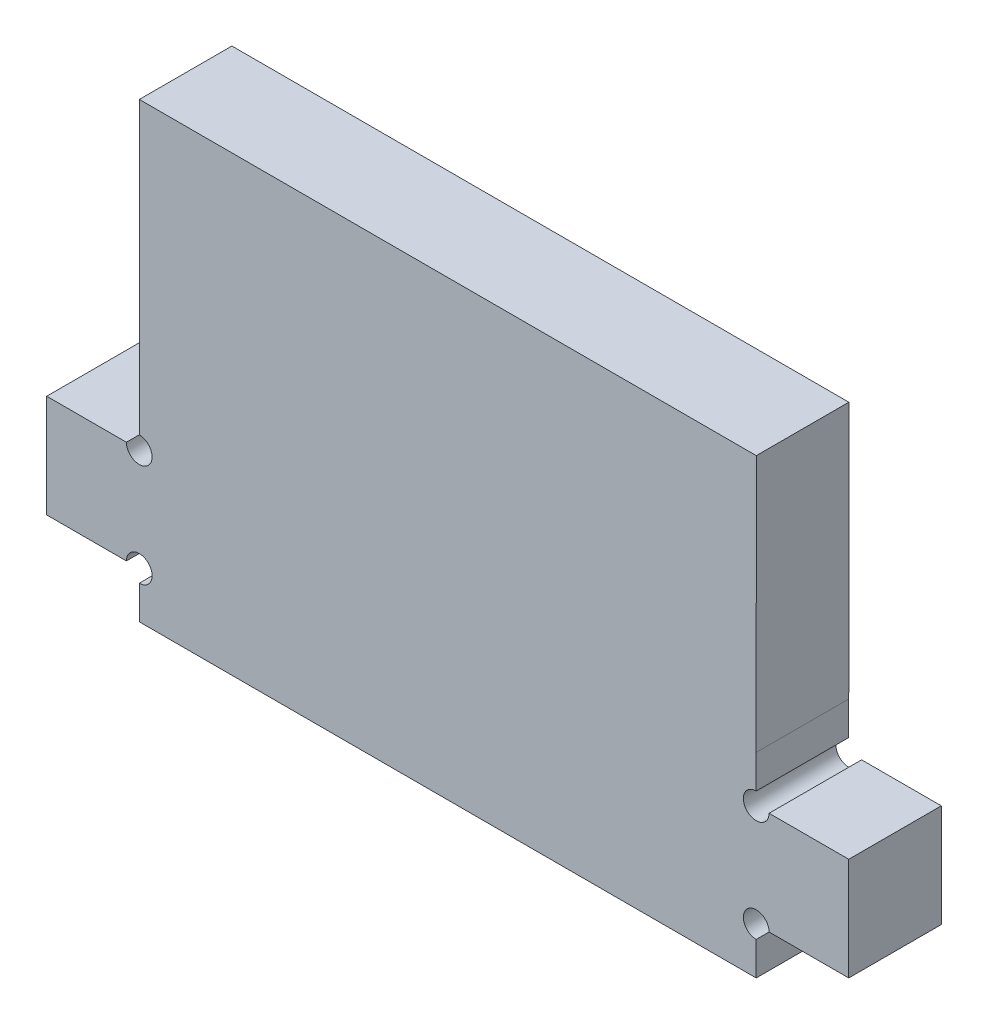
ISO-10303-21;
HEADER;
FILE_DESCRIPTION(('STEP AP214'),'2;1');
FILE_NAME('part.step','',(''),(''),'','','');
FILE_SCHEMA(('AUTOMOTIVE_DESIGN { 1 0 10303 214 1 1 1 1 }'));
ENDSEC;
DATA;
#1=APPLICATION_CONTEXT('core data for automotive mechanical design processes');
#2=APPLICATION_PROTOCOL_DEFINITION('international standard','automotive_design',2000,#1);
#3=PRODUCT_CONTEXT('',#1,'mechanical');
#4=PRODUCT('Part','Part','',(#3));
#5=PRODUCT_RELATED_PRODUCT_CATEGORY('part','',(#4));
#6=PRODUCT_DEFINITION_FORMATION('','',#4);
#7=PRODUCT_DEFINITION_CONTEXT('part definition',#1,'design');
#8=PRODUCT_DEFINITION('design','',#6,#7);
#9=PRODUCT_DEFINITION_SHAPE('','',#8);
#10=(LENGTH_UNIT() NAMED_UNIT(*) SI_UNIT(.MILLI.,.METRE.));
#11=(NAMED_UNIT(*) PLANE_ANGLE_UNIT() SI_UNIT($,.RADIAN.));
#12=(NAMED_UNIT(*) SI_UNIT($,.STERADIAN.) SOLID_ANGLE_UNIT());
#13=UNCERTAINTY_MEASURE_WITH_UNIT(LENGTH_MEASURE(1.E-05),#10,'distance_accuracy_value','');
#14=(GEOMETRIC_REPRESENTATION_CONTEXT(3) GLOBAL_UNCERTAINTY_ASSIGNED_CONTEXT((#13)) GLOBAL_UNIT_ASSIGNED_CONTEXT((#10,
#11,#12)) REPRESENTATION_CONTEXT('',''));
#15=CARTESIAN_POINT('',(0.,0.,0.));
#16=DIRECTION('',(0.,0.,1.));
#17=DIRECTION('',(1.,0.,0.));
#18=AXIS2_PLACEMENT_3D('',#15,#16,#17);
#19=CARTESIAN_POINT('',(-60.,19.,18.));
#20=DIRECTION('',(0.,-1.,0.));
#21=DIRECTION('',(0.,0.,-1.));
#22=AXIS2_PLACEMENT_3D('',#19,#20,#21);
#23=PLANE('',#22);
#24=DIRECTION('',(0.,0.,1.));
#25=VECTOR('',#24,1.);
#26=CARTESIAN_POINT('',(-59.9826271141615,19.,-130.));
#27=LINE('',#26,#25);
#28=CARTESIAN_POINT('',(-59.9826271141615,19.,0.));
#29=VERTEX_POINT('',#28);
#30=CARTESIAN_POINT('',(-59.9826271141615,19.,18.));
#31=VERTEX_POINT('',#30);
#32=EDGE_CURVE('E50',#29,#31,#27,.T.);
#33=ORIENTED_EDGE('',*,*,#32,.F.);
#34=DIRECTION('',(-1.,0.,0.));
#35=VECTOR('',#34,1.);
#36=CARTESIAN_POINT('',(-60.,19.,0.));
#37=LINE('',#36,#35);
#38=CARTESIAN_POINT('',(-60.,19.,0.));
#39=VERTEX_POINT('',#38);
#40=EDGE_CURVE('E212',#29,#39,#37,.T.);
#41=ORIENTED_EDGE('',*,*,#40,.T.);
#42=DIRECTION('',(0.,0.,-1.));
#43=VECTOR('',#42,1.);
#44=CARTESIAN_POINT('',(-60.,19.,18.));
#45=LINE('',#44,#43);
#46=CARTESIAN_POINT('',(-60.,19.,18.));
#47=VERTEX_POINT('',#46);
#48=EDGE_CURVE('E229',#47,#39,#45,.T.);
#49=ORIENTED_EDGE('',*,*,#48,.F.);
#50=DIRECTION('',(-1.,0.,0.));
#51=VECTOR('',#50,1.);
#52=CARTESIAN_POINT('',(-60.,19.,18.));
#53=LINE('',#52,#51);
#54=EDGE_CURVE('E293',#31,#47,#53,.T.);
#55=ORIENTED_EDGE('',*,*,#54,.F.);
#56=EDGE_LOOP('',(#33,#41,#49,#55));
#57=FACE_BOUND('',#56,.T.);
#58=ADVANCED_FACE('F35',(#57),#23,.F.);
#59=CARTESIAN_POINT('',(-60.,-10.,18.));
#60=DIRECTION('',(0.,0.,-1.));
#61=DIRECTION('',(-1.,0.,0.));
#62=AXIS2_PLACEMENT_3D('',#59,#60,#61);
#63=CYLINDRICAL_SURFACE('',#62,2.5);
#64=CARTESIAN_POINT('',(-60.,-10.,0.));
#65=DIRECTION('',(0.,0.,-1.));
#66=DIRECTION('',(1.,0.,0.));
#67=AXIS2_PLACEMENT_3D('',#64,#65,#66);
#68=CIRCLE('',#67,2.5);
#69=CARTESIAN_POINT('',(-62.5,-10.,0.));
#70=VERTEX_POINT('',#69);
#71=CARTESIAN_POINT('',(-60.,-12.5,0.));
#72=VERTEX_POINT('',#71);
#73=EDGE_CURVE('E190',#70,#72,#68,.T.);
#74=ORIENTED_EDGE('',*,*,#73,.T.);
#75=DIRECTION('',(0.,0.,-1.));
#76=VECTOR('',#75,1.);
#77=CARTESIAN_POINT('',(-60.,-12.5,18.));
#78=LINE('',#77,#76);
#79=CARTESIAN_POINT('',(-60.,-12.5,18.));
#80=VERTEX_POINT('',#79);
#81=EDGE_CURVE('E11',#80,#72,#78,.T.);
#82=ORIENTED_EDGE('',*,*,#81,.F.);
#83=CARTESIAN_POINT('',(-60.,-10.,18.));
#84=DIRECTION('',(0.,0.,-1.));
#85=DIRECTION('',(1.,0.,0.));
#86=AXIS2_PLACEMENT_3D('',#83,#84,#85);
#87=CIRCLE('',#86,2.5);
#88=CARTESIAN_POINT('',(-62.5,-10.,18.));
#89=VERTEX_POINT('',#88);
#90=EDGE_CURVE('E222',#89,#80,#87,.T.);
#91=ORIENTED_EDGE('',*,*,#90,.F.);
#92=DIRECTION('',(0.,0.,-1.));
#93=VECTOR('',#92,1.);
#94=CARTESIAN_POINT('',(-62.5,-10.,18.));
#95=LINE('',#94,#93);
#96=EDGE_CURVE('E186',#89,#70,#95,.T.);
#97=ORIENTED_EDGE('',*,*,#96,.T.);
#98=EDGE_LOOP('',(#74,#82,#91,#97));
#99=FACE_BOUND('',#98,.T.);
#100=ADVANCED_FACE('F37',(#99),#63,.F.);
#101=CARTESIAN_POINT('',(-60.,-12.5,18.));
#102=DIRECTION('',(1.,0.,0.));
#103=DIRECTION('',(0.,0.,-1.));
#104=AXIS2_PLACEMENT_3D('',#101,#102,#103);
#105=PLANE('',#104);
#106=DIRECTION('',(0.,-1.,0.));
#107=VECTOR('',#106,1.);
#108=CARTESIAN_POINT('',(-60.,-12.5,0.));
#109=LINE('',#108,#107);
#110=CARTESIAN_POINT('',(-60.,-19.,0.));
#111=VERTEX_POINT('',#110);
#112=EDGE_CURVE('E193',#72,#111,#109,.T.);
#113=ORIENTED_EDGE('',*,*,#112,.T.);
#114=DIRECTION('',(0.,0.,-1.));
#115=VECTOR('',#114,1.);
#116=CARTESIAN_POINT('',(-60.,-19.,18.));
#117=LINE('',#116,#115);
#118=CARTESIAN_POINT('',(-60.,-19.,18.));
#119=VERTEX_POINT('',#118);
#120=EDGE_CURVE('E43',#119,#111,#117,.T.);
#121=ORIENTED_EDGE('',*,*,#120,.F.);
#122=DIRECTION('',(0.,-1.,0.));
#123=VECTOR('',#122,1.);
#124=CARTESIAN_POINT('',(-60.,-12.5,18.));
#125=LINE('',#124,#123);
#126=EDGE_CURVE('E123',#80,#119,#125,.T.);
#127=ORIENTED_EDGE('',*,*,#126,.F.);
#128=ORIENTED_EDGE('',*,*,#81,.T.);
#129=EDGE_LOOP('',(#113,#121,#127,#128));
#130=FACE_BOUND('',#129,.T.);
#131=ADVANCED_FACE('F394',(#130),#105,.F.);
#132=CARTESIAN_POINT('',(-60.,-19.,18.));
#133=DIRECTION('',(0.,1.,0.));
#134=DIRECTION('',(0.,0.,1.));
#135=AXIS2_PLACEMENT_3D('',#132,#133,#134);
#136=PLANE('',#135);
#137=DIRECTION('',(1.,0.,0.));
#138=VECTOR('',#137,1.);
#139=CARTESIAN_POINT('',(-60.,-19.,0.));
#140=LINE('',#139,#138);
#141=CARTESIAN_POINT('',(60.,-19.,0.));
#142=VERTEX_POINT('',#141);
#143=EDGE_CURVE('E196',#111,#142,#140,.T.);
#144=ORIENTED_EDGE('',*,*,#143,.T.);
#145=DIRECTION('',(0.,0.,-1.));
#146=VECTOR('',#145,1.);
#147=CARTESIAN_POINT('',(60.,-19.,18.));
#148=LINE('',#147,#146);
#149=CARTESIAN_POINT('',(60.,-19.,18.));
#150=VERTEX_POINT('',#149);
#151=EDGE_CURVE('E253',#150,#142,#148,.T.);
#152=ORIENTED_EDGE('',*,*,#151,.F.);
#153=DIRECTION('',(1.,0.,0.));
#154=VECTOR('',#153,1.);
#155=CARTESIAN_POINT('',(-60.,-19.,18.));
#156=LINE('',#155,#154);
#157=EDGE_CURVE('E261',#119,#150,#156,.T.);
#158=ORIENTED_EDGE('',*,*,#157,.F.);
#159=ORIENTED_EDGE('',*,*,#120,.T.);
#160=EDGE_LOOP('',(#144,#152,#158,#159));
#161=FACE_BOUND('',#160,.T.);
#162=ADVANCED_FACE('F259',(#161),#136,.F.);
#163=CARTESIAN_POINT('',(60.,-12.5,18.));
#164=DIRECTION('',(-1.,0.,0.));
#165=DIRECTION('',(0.,0.,1.));
#166=AXIS2_PLACEMENT_3D('',#163,#164,#165);
#167=PLANE('',#166);
#168=DIRECTION('',(0.,1.,0.));
#169=VECTOR('',#168,1.);
#170=CARTESIAN_POINT('',(60.,-12.5,0.));
#171=LINE('',#170,#169);
#172=CARTESIAN_POINT('',(60.,-12.5,0.));
#173=VERTEX_POINT('',#172);
#174=EDGE_CURVE('E198',#142,#173,#171,.T.);
#175=ORIENTED_EDGE('',*,*,#174,.T.);
#176=DIRECTION('',(0.,0.,-1.));
#177=VECTOR('',#176,1.);
#178=CARTESIAN_POINT('',(60.,-12.5,18.));
#179=LINE('',#178,#177);
#180=CARTESIAN_POINT('',(60.,-12.5,18.));
#181=VERTEX_POINT('',#180);
#182=EDGE_CURVE('E250',#181,#173,#179,.T.);
#183=ORIENTED_EDGE('',*,*,#182,.F.);
#184=DIRECTION('',(0.,1.,0.));
#185=VECTOR('',#184,1.);
#186=CARTESIAN_POINT('',(60.,-12.5,18.));
#187=LINE('',#186,#185);
#188=EDGE_CURVE('E279',#150,#181,#187,.T.);
#189=ORIENTED_EDGE('',*,*,#188,.F.);
#190=ORIENTED_EDGE('',*,*,#151,.T.);
#191=EDGE_LOOP('',(#175,#183,#189,#190));
#192=FACE_BOUND('',#191,.T.);
#193=ADVANCED_FACE('F270',(#192),#167,.F.);
#194=CARTESIAN_POINT('',(60.,-10.,18.));
#195=DIRECTION('',(0.,0.,-1.));
#196=DIRECTION('',(-1.,0.,0.));
#197=AXIS2_PLACEMENT_3D('',#194,#195,#196);
#198=CYLINDRICAL_SURFACE('',#197,2.5);
#199=CARTESIAN_POINT('',(60.,-10.,0.));
#200=DIRECTION('',(0.,0.,-1.));
#201=DIRECTION('',(-1.,0.,0.));
#202=AXIS2_PLACEMENT_3D('',#199,#200,#201);
#203=CIRCLE('',#202,2.5);
#204=CARTESIAN_POINT('',(62.5,-10.,0.));
#205=VERTEX_POINT('',#204);
#206=EDGE_CURVE('E200',#173,#205,#203,.T.);
#207=ORIENTED_EDGE('',*,*,#206,.T.);
#208=DIRECTION('',(0.,0.,-1.));
#209=VECTOR('',#208,1.);
#210=CARTESIAN_POINT('',(62.5,-10.,18.));
#211=LINE('',#210,#209);
#212=CARTESIAN_POINT('',(62.5,-10.,18.));
#213=VERTEX_POINT('',#212);
#214=EDGE_CURVE('E247',#213,#205,#211,.T.);
#215=ORIENTED_EDGE('',*,*,#214,.F.);
#216=CARTESIAN_POINT('',(60.,-10.,18.));
#217=DIRECTION('',(0.,0.,-1.));
#218=DIRECTION('',(-1.,0.,0.));
#219=AXIS2_PLACEMENT_3D('',#216,#217,#218);
#220=CIRCLE('',#219,2.5);
#221=EDGE_CURVE('E276',#181,#213,#220,.T.);
#222=ORIENTED_EDGE('',*,*,#221,.F.);
#223=ORIENTED_EDGE('',*,*,#182,.T.);
#224=EDGE_LOOP('',(#207,#215,#222,#223));
#225=FACE_BOUND('',#224,.T.);
#226=ADVANCED_FACE('F274',(#225),#198,.F.);
#227=CARTESIAN_POINT('',(78.,-10.,18.));
#228=DIRECTION('',(0.,1.,0.));
#229=DIRECTION('',(0.,0.,1.));
#230=AXIS2_PLACEMENT_3D('',#227,#228,#229);
#231=PLANE('',#230);
#232=DIRECTION('',(1.,0.,0.));
#233=VECTOR('',#232,1.);
#234=CARTESIAN_POINT('',(78.,-10.,0.));
#235=LINE('',#234,#233);
#236=CARTESIAN_POINT('',(78.,-10.,0.));
#237=VERTEX_POINT('',#236);
#238=EDGE_CURVE('E202',#205,#237,#235,.T.);
#239=ORIENTED_EDGE('',*,*,#238,.T.);
#240=DIRECTION('',(0.,0.,-1.));
#241=VECTOR('',#240,1.);
#242=CARTESIAN_POINT('',(78.,-10.,18.));
#243=LINE('',#242,#241);
#244=CARTESIAN_POINT('',(78.,-10.,18.));
#245=VERTEX_POINT('',#244);
#246=EDGE_CURVE('E244',#245,#237,#243,.T.);
#247=ORIENTED_EDGE('',*,*,#246,.F.);
#248=DIRECTION('',(1.,0.,0.));
#249=VECTOR('',#248,1.);
#250=CARTESIAN_POINT('',(78.,-10.,18.));
#251=LINE('',#250,#249);
#252=EDGE_CURVE('E278',#213,#245,#251,.T.);
#253=ORIENTED_EDGE('',*,*,#252,.F.);
#254=ORIENTED_EDGE('',*,*,#214,.T.);
#255=EDGE_LOOP('',(#239,#247,#253,#254));
#256=FACE_BOUND('',#255,.T.);
#257=ADVANCED_FACE('F378',(#256),#231,.F.);
#258=CARTESIAN_POINT('',(78.,-10.,18.));
#259=DIRECTION('',(-1.,0.,0.));
#260=DIRECTION('',(0.,-1.,0.));
#261=AXIS2_PLACEMENT_3D('',#258,#259,#260);
#262=PLANE('',#261);
#263=DIRECTION('',(0.,1.,0.));
#264=VECTOR('',#263,1.);
#265=CARTESIAN_POINT('',(78.,-10.,0.));
#266=LINE('',#265,#264);
#267=CARTESIAN_POINT('',(78.,10.,0.));
#268=VERTEX_POINT('',#267);
#269=EDGE_CURVE('E204',#237,#268,#266,.T.);
#270=ORIENTED_EDGE('',*,*,#269,.T.);
#271=DIRECTION('',(0.,0.,-1.));
#272=VECTOR('',#271,1.);
#273=CARTESIAN_POINT('',(78.,10.,18.));
#274=LINE('',#273,#272);
#275=CARTESIAN_POINT('',(78.,10.,18.));
#276=VERTEX_POINT('',#275);
#277=EDGE_CURVE('E241',#276,#268,#274,.T.);
#278=ORIENTED_EDGE('',*,*,#277,.F.);
#279=DIRECTION('',(0.,1.,0.));
#280=VECTOR('',#279,1.);
#281=CARTESIAN_POINT('',(78.,-10.,18.));
#282=LINE('',#281,#280);
#283=EDGE_CURVE('E281',#245,#276,#282,.T.);
#284=ORIENTED_EDGE('',*,*,#283,.F.);
#285=ORIENTED_EDGE('',*,*,#246,.T.);
#286=EDGE_LOOP('',(#270,#278,#284,#285));
#287=FACE_BOUND('',#286,.T.);
#288=ADVANCED_FACE('F375',(#287),#262,.F.);
#289=CARTESIAN_POINT('',(78.,10.,18.));
#290=DIRECTION('',(0.,-1.,0.));
#291=DIRECTION('',(0.,0.,-1.));
#292=AXIS2_PLACEMENT_3D('',#289,#290,#291);
#293=PLANE('',#292);
#294=DIRECTION('',(-1.,0.,0.));
#295=VECTOR('',#294,1.);
#296=CARTESIAN_POINT('',(78.,10.,0.));
#297=LINE('',#296,#295);
#298=CARTESIAN_POINT('',(62.5,10.,0.));
#299=VERTEX_POINT('',#298);
#300=EDGE_CURVE('E206',#268,#299,#297,.T.);
#301=ORIENTED_EDGE('',*,*,#300,.T.);
#302=DIRECTION('',(0.,0.,-1.));
#303=VECTOR('',#302,1.);
#304=CARTESIAN_POINT('',(62.5,10.,18.));
#305=LINE('',#304,#303);
#306=CARTESIAN_POINT('',(62.5,10.,18.));
#307=VERTEX_POINT('',#306);
#308=EDGE_CURVE('E238',#307,#299,#305,.T.);
#309=ORIENTED_EDGE('',*,*,#308,.F.);
#310=DIRECTION('',(-1.,0.,0.));
#311=VECTOR('',#310,1.);
#312=CARTESIAN_POINT('',(78.,10.,18.));
#313=LINE('',#312,#311);
#314=EDGE_CURVE('E287',#276,#307,#313,.T.);
#315=ORIENTED_EDGE('',*,*,#314,.F.);
#316=ORIENTED_EDGE('',*,*,#277,.T.);
#317=EDGE_LOOP('',(#301,#309,#315,#316));
#318=FACE_BOUND('',#317,.T.);
#319=ADVANCED_FACE('F371',(#318),#293,.F.);
#320=CARTESIAN_POINT('',(60.,10.,18.));
#321=DIRECTION('',(0.,0.,-1.));
#322=DIRECTION('',(-1.,0.,0.));
#323=AXIS2_PLACEMENT_3D('',#320,#321,#322);
#324=CYLINDRICAL_SURFACE('',#323,2.5);
#325=CARTESIAN_POINT('',(60.,10.,0.));
#326=DIRECTION('',(0.,0.,-1.));
#327=DIRECTION('',(-1.,0.,0.));
#328=AXIS2_PLACEMENT_3D('',#325,#326,#327);
#329=CIRCLE('',#328,2.5);
#330=CARTESIAN_POINT('',(60.,12.5,0.));
#331=VERTEX_POINT('',#330);
#332=EDGE_CURVE('E208',#299,#331,#329,.T.);
#333=ORIENTED_EDGE('',*,*,#332,.T.);
#334=DIRECTION('',(0.,0.,-1.));
#335=VECTOR('',#334,1.);
#336=CARTESIAN_POINT('',(60.,12.5,18.));
#337=LINE('',#336,#335);
#338=CARTESIAN_POINT('',(60.,12.5,18.));
#339=VERTEX_POINT('',#338);
#340=EDGE_CURVE('E235',#339,#331,#337,.T.);
#341=ORIENTED_EDGE('',*,*,#340,.F.);
#342=CARTESIAN_POINT('',(60.,10.,18.));
#343=DIRECTION('',(0.,0.,-1.));
#344=DIRECTION('',(-1.,0.,0.));
#345=AXIS2_PLACEMENT_3D('',#342,#343,#344);
#346=CIRCLE('',#345,2.5);
#347=EDGE_CURVE('E289',#307,#339,#346,.T.);
#348=ORIENTED_EDGE('',*,*,#347,.F.);
#349=ORIENTED_EDGE('',*,*,#308,.T.);
#350=EDGE_LOOP('',(#333,#341,#348,#349));
#351=FACE_BOUND('',#350,.T.);
#352=ADVANCED_FACE('F367',(#351),#324,.F.);
#353=CARTESIAN_POINT('',(60.,12.5,18.));
#354=DIRECTION('',(-1.,0.,0.));
#355=DIRECTION('',(0.,0.,1.));
#356=AXIS2_PLACEMENT_3D('',#353,#354,#355);
#357=PLANE('',#356);
#358=DIRECTION('',(0.,1.,0.));
#359=VECTOR('',#358,1.);
#360=CARTESIAN_POINT('',(60.,12.5,0.));
#361=LINE('',#360,#359);
#362=CARTESIAN_POINT('',(60.,19.,0.));
#363=VERTEX_POINT('',#362);
#364=EDGE_CURVE('E210',#331,#363,#361,.T.);
#365=ORIENTED_EDGE('',*,*,#364,.T.);
#366=DIRECTION('',(0.,0.,-1.));
#367=VECTOR('',#366,1.);
#368=CARTESIAN_POINT('',(60.,19.,18.));
#369=LINE('',#368,#367);
#370=CARTESIAN_POINT('',(60.,19.,18.));
#371=VERTEX_POINT('',#370);
#372=EDGE_CURVE('E232',#371,#363,#369,.T.);
#373=ORIENTED_EDGE('',*,*,#372,.F.);
#374=DIRECTION('',(0.,1.,0.));
#375=VECTOR('',#374,1.);
#376=CARTESIAN_POINT('',(60.,12.5,18.));
#377=LINE('',#376,#375);
#378=EDGE_CURVE('E291',#339,#371,#377,.T.);
#379=ORIENTED_EDGE('',*,*,#378,.F.);
#380=ORIENTED_EDGE('',*,*,#340,.T.);
#381=EDGE_LOOP('',(#365,#373,#379,#380));
#382=FACE_BOUND('',#381,.T.);
#383=ADVANCED_FACE('F361',(#382),#357,.F.);
#384=CARTESIAN_POINT('',(-60.,12.5,18.));
#385=DIRECTION('',(1.,0.,0.));
#386=DIRECTION('',(0.,0.,-1.));
#387=AXIS2_PLACEMENT_3D('',#384,#385,#386);
#388=PLANE('',#387);
#389=DIRECTION('',(0.,-1.,0.));
#390=VECTOR('',#389,1.);
#391=CARTESIAN_POINT('',(-60.,12.5,0.));
#392=LINE('',#391,#390);
#393=CARTESIAN_POINT('',(-60.,12.5,0.));
#394=VERTEX_POINT('',#393);
#395=EDGE_CURVE('E214',#39,#394,#392,.T.);
#396=ORIENTED_EDGE('',*,*,#395,.T.);
#397=DIRECTION('',(0.,0.,-1.));
#398=VECTOR('',#397,1.);
#399=CARTESIAN_POINT('',(-60.,12.5,18.));
#400=LINE('',#399,#398);
#401=CARTESIAN_POINT('',(-60.,12.5,18.));
#402=VERTEX_POINT('',#401);
#403=EDGE_CURVE('E226',#402,#394,#400,.T.);
#404=ORIENTED_EDGE('',*,*,#403,.F.);
#405=DIRECTION('',(0.,-1.,0.));
#406=VECTOR('',#405,1.);
#407=CARTESIAN_POINT('',(-60.,12.5,18.));
#408=LINE('',#407,#406);
#409=EDGE_CURVE('E295',#47,#402,#408,.T.);
#410=ORIENTED_EDGE('',*,*,#409,.F.);
#411=ORIENTED_EDGE('',*,*,#48,.T.);
#412=EDGE_LOOP('',(#396,#404,#410,#411));
#413=FACE_BOUND('',#412,.T.);
#414=ADVANCED_FACE('F301',(#413),#388,.F.);
#415=CARTESIAN_POINT('',(-60.,10.,18.));
#416=DIRECTION('',(0.,0.,-1.));
#417=DIRECTION('',(-1.,0.,0.));
#418=AXIS2_PLACEMENT_3D('',#415,#416,#417);
#419=CYLINDRICAL_SURFACE('',#418,2.5);
#420=CARTESIAN_POINT('',(-60.,10.,0.));
#421=DIRECTION('',(0.,0.,-1.));
#422=DIRECTION('',(1.,0.,0.));
#423=AXIS2_PLACEMENT_3D('',#420,#421,#422);
#424=CIRCLE('',#423,2.5);
#425=CARTESIAN_POINT('',(-62.5,10.,0.));
#426=VERTEX_POINT('',#425);
#427=EDGE_CURVE('E216',#394,#426,#424,.T.);
#428=ORIENTED_EDGE('',*,*,#427,.T.);
#429=DIRECTION('',(0.,0.,-1.));
#430=VECTOR('',#429,1.);
#431=CARTESIAN_POINT('',(-62.5,10.,18.));
#432=LINE('',#431,#430);
#433=CARTESIAN_POINT('',(-62.5,10.,18.));
#434=VERTEX_POINT('',#433);
#435=EDGE_CURVE('E181',#434,#426,#432,.T.);
#436=ORIENTED_EDGE('',*,*,#435,.F.);
#437=CARTESIAN_POINT('',(-60.,10.,18.));
#438=DIRECTION('',(0.,0.,-1.));
#439=DIRECTION('',(1.,0.,0.));
#440=AXIS2_PLACEMENT_3D('',#437,#438,#439);
#441=CIRCLE('',#440,2.5);
#442=EDGE_CURVE('E169',#402,#434,#441,.T.);
#443=ORIENTED_EDGE('',*,*,#442,.F.);
#444=ORIENTED_EDGE('',*,*,#403,.T.);
#445=EDGE_LOOP('',(#428,#436,#443,#444));
#446=FACE_BOUND('',#445,.T.);
#447=ADVANCED_FACE('F305',(#446),#419,.F.);
#448=CARTESIAN_POINT('',(-78.,10.,18.));
#449=DIRECTION('',(0.,-1.,0.));
#450=DIRECTION('',(0.,0.,-1.));
#451=AXIS2_PLACEMENT_3D('',#448,#449,#450);
#452=PLANE('',#451);
#453=DIRECTION('',(-1.,0.,0.));
#454=VECTOR('',#453,1.);
#455=CARTESIAN_POINT('',(-78.,10.,0.));
#456=LINE('',#455,#454);
#457=CARTESIAN_POINT('',(-78.,10.,0.));
#458=VERTEX_POINT('',#457);
#459=EDGE_CURVE('E178',#426,#458,#456,.T.);
#460=ORIENTED_EDGE('',*,*,#459,.T.);
#461=DIRECTION('',(0.,0.,-1.));
#462=VECTOR('',#461,1.);
#463=CARTESIAN_POINT('',(-78.,10.,18.));
#464=LINE('',#463,#462);
#465=CARTESIAN_POINT('',(-78.,10.,18.));
#466=VERTEX_POINT('',#465);
#467=EDGE_CURVE('E175',#466,#458,#464,.T.);
#468=ORIENTED_EDGE('',*,*,#467,.F.);
#469=DIRECTION('',(-1.,0.,0.));
#470=VECTOR('',#469,1.);
#471=CARTESIAN_POINT('',(-78.,10.,18.));
#472=LINE('',#471,#470);
#473=EDGE_CURVE('E162',#434,#466,#472,.T.);
#474=ORIENTED_EDGE('',*,*,#473,.F.);
#475=ORIENTED_EDGE('',*,*,#435,.T.);
#476=EDGE_LOOP('',(#460,#468,#474,#475));
#477=FACE_BOUND('',#476,.T.);
#478=ADVANCED_FACE('F176',(#477),#452,.F.);
#479=CARTESIAN_POINT('',(-78.,-10.,18.));
#480=DIRECTION('',(1.,0.,0.));
#481=DIRECTION('',(0.,1.,0.));
#482=AXIS2_PLACEMENT_3D('',#479,#480,#481);
#483=PLANE('',#482);
#484=DIRECTION('',(0.,-1.,0.));
#485=VECTOR('',#484,1.);
#486=CARTESIAN_POINT('',(-78.,-10.,0.));
#487=LINE('',#486,#485);
#488=CARTESIAN_POINT('',(-78.,-10.,0.));
#489=VERTEX_POINT('',#488);
#490=EDGE_CURVE('E219',#458,#489,#487,.T.);
#491=ORIENTED_EDGE('',*,*,#490,.T.);
#492=DIRECTION('',(0.,0.,-1.));
#493=VECTOR('',#492,1.);
#494=CARTESIAN_POINT('',(-78.,-10.,18.));
#495=LINE('',#494,#493);
#496=CARTESIAN_POINT('',(-78.,-10.,18.));
#497=VERTEX_POINT('',#496);
#498=EDGE_CURVE('E182',#497,#489,#495,.T.);
#499=ORIENTED_EDGE('',*,*,#498,.F.);
#500=DIRECTION('',(0.,-1.,0.));
#501=VECTOR('',#500,1.);
#502=CARTESIAN_POINT('',(-78.,-10.,18.));
#503=LINE('',#502,#501);
#504=EDGE_CURVE('E166',#466,#497,#503,.T.);
#505=ORIENTED_EDGE('',*,*,#504,.F.);
#506=ORIENTED_EDGE('',*,*,#467,.T.);
#507=EDGE_LOOP('',(#491,#499,#505,#506));
#508=FACE_BOUND('',#507,.T.);
#509=ADVANCED_FACE('F184',(#508),#483,.F.);
#510=CARTESIAN_POINT('',(-78.,-10.,18.));
#511=DIRECTION('',(0.,1.,0.));
#512=DIRECTION('',(0.,0.,1.));
#513=AXIS2_PLACEMENT_3D('',#510,#511,#512);
#514=PLANE('',#513);
#515=DIRECTION('',(1.,0.,0.));
#516=VECTOR('',#515,1.);
#517=CARTESIAN_POINT('',(-78.,-10.,0.));
#518=LINE('',#517,#516);
#519=EDGE_CURVE('E115',#489,#70,#518,.T.);
#520=ORIENTED_EDGE('',*,*,#519,.T.);
#521=ORIENTED_EDGE('',*,*,#96,.F.);
#522=DIRECTION('',(1.,0.,0.));
#523=VECTOR('',#522,1.);
#524=CARTESIAN_POINT('',(-78.,-10.,18.));
#525=LINE('',#524,#523);
#526=EDGE_CURVE('E59',#497,#89,#525,.T.);
#527=ORIENTED_EDGE('',*,*,#526,.F.);
#528=ORIENTED_EDGE('',*,*,#498,.T.);
#529=EDGE_LOOP('',(#520,#521,#527,#528));
#530=FACE_BOUND('',#529,.T.);
#531=ADVANCED_FACE('F306',(#530),#514,.F.);
#532=CARTESIAN_POINT('',(-60.,-10.,18.));
#533=DIRECTION('',(0.,0.,1.));
#534=DIRECTION('',(1.,0.,0.));
#535=AXIS2_PLACEMENT_3D('',#532,#533,#534);
#536=PLANE('',#535);
#537=ORIENTED_EDGE('',*,*,#90,.T.);
#538=ORIENTED_EDGE('',*,*,#126,.T.);
#539=ORIENTED_EDGE('',*,*,#157,.T.);
#540=ORIENTED_EDGE('',*,*,#188,.T.);
#541=ORIENTED_EDGE('',*,*,#221,.T.);
#542=ORIENTED_EDGE('',*,*,#252,.T.);
#543=ORIENTED_EDGE('',*,*,#283,.T.);
#544=ORIENTED_EDGE('',*,*,#314,.T.);
#545=ORIENTED_EDGE('',*,*,#347,.T.);
#546=ORIENTED_EDGE('',*,*,#378,.T.);
#547=DIRECTION('',(-0.000347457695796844,-0.999999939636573,0.));
#548=VECTOR('',#547,1.);
#549=CARTESIAN_POINT('',(59.9933910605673,-0.0208451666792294,18.));
#550=LINE('',#549,#548);
#551=CARTESIAN_POINT('',(60.0173728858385,69.,18.));
#552=VERTEX_POINT('',#551);
#553=EDGE_CURVE('E329',#552,#371,#550,.T.);
#554=ORIENTED_EDGE('',*,*,#553,.F.);
#555=DIRECTION('',(1.,0.,0.));
#556=VECTOR('',#555,1.);
#557=CARTESIAN_POINT('',(0.,69.,18.));
#558=LINE('',#557,#556);
#559=CARTESIAN_POINT('',(-59.9826271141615,69.,18.));
#560=VERTEX_POINT('',#559);
#561=EDGE_CURVE('E326',#560,#552,#558,.T.);
#562=ORIENTED_EDGE('',*,*,#561,.F.);
#563=DIRECTION('',(0.,-1.,0.));
#564=VECTOR('',#563,1.);
#565=CARTESIAN_POINT('',(-59.9826271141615,0.,18.));
#566=LINE('',#565,#564);
#567=EDGE_CURVE('E321',#560,#31,#566,.T.);
#568=ORIENTED_EDGE('',*,*,#567,.T.);
#569=ORIENTED_EDGE('',*,*,#54,.T.);
#570=ORIENTED_EDGE('',*,*,#409,.T.);
#571=ORIENTED_EDGE('',*,*,#442,.T.);
#572=ORIENTED_EDGE('',*,*,#473,.T.);
#573=ORIENTED_EDGE('',*,*,#504,.T.);
#574=ORIENTED_EDGE('',*,*,#526,.T.);
#575=EDGE_LOOP('',(#537,#538,#539,#540,#541,#542,#543,#544,#545,#546,#554,#562,#568,#569,#570,
#571,#572,#573,#574));
#576=FACE_BOUND('',#575,.T.);
#577=ADVANCED_FACE('F164',(#576),#536,.T.);
#578=CARTESIAN_POINT('',(-60.,-10.,0.));
#579=DIRECTION('',(0.,0.,1.));
#580=DIRECTION('',(1.,0.,0.));
#581=AXIS2_PLACEMENT_3D('',#578,#579,#580);
#582=PLANE('',#581);
#583=ORIENTED_EDGE('',*,*,#73,.F.);
#584=ORIENTED_EDGE('',*,*,#519,.F.);
#585=ORIENTED_EDGE('',*,*,#490,.F.);
#586=ORIENTED_EDGE('',*,*,#459,.F.);
#587=ORIENTED_EDGE('',*,*,#427,.F.);
#588=ORIENTED_EDGE('',*,*,#395,.F.);
#589=ORIENTED_EDGE('',*,*,#40,.F.);
#590=DIRECTION('',(0.,1.,0.));
#591=VECTOR('',#590,1.);
#592=CARTESIAN_POINT('',(-59.9826271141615,0.,0.));
#593=LINE('',#592,#591);
#594=CARTESIAN_POINT('',(-59.9826271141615,69.,0.));
#595=VERTEX_POINT('',#594);
#596=EDGE_CURVE('E316',#29,#595,#593,.T.);
#597=ORIENTED_EDGE('',*,*,#596,.T.);
#598=DIRECTION('',(-1.,0.,0.));
#599=VECTOR('',#598,1.);
#600=CARTESIAN_POINT('',(0.,69.,0.));
#601=LINE('',#600,#599);
#602=CARTESIAN_POINT('',(60.0173728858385,69.,0.));
#603=VERTEX_POINT('',#602);
#604=EDGE_CURVE('E313',#603,#595,#601,.T.);
#605=ORIENTED_EDGE('',*,*,#604,.F.);
#606=DIRECTION('',(0.000347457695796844,0.999999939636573,0.));
#607=VECTOR('',#606,1.);
#608=CARTESIAN_POINT('',(59.9933910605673,-0.0208451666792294,0.));
#609=LINE('',#608,#607);
#610=EDGE_CURVE('E194',#363,#603,#609,.T.);
#611=ORIENTED_EDGE('',*,*,#610,.F.);
#612=ORIENTED_EDGE('',*,*,#364,.F.);
#613=ORIENTED_EDGE('',*,*,#332,.F.);
#614=ORIENTED_EDGE('',*,*,#300,.F.);
#615=ORIENTED_EDGE('',*,*,#269,.F.);
#616=ORIENTED_EDGE('',*,*,#238,.F.);
#617=ORIENTED_EDGE('',*,*,#206,.F.);
#618=ORIENTED_EDGE('',*,*,#174,.F.);
#619=ORIENTED_EDGE('',*,*,#143,.F.);
#620=ORIENTED_EDGE('',*,*,#112,.F.);
#621=EDGE_LOOP('',(#583,#584,#585,#586,#587,#588,#589,#597,#605,#611,#612,#613,#614,#615,#616,
#617,#618,#619,#620));
#622=FACE_BOUND('',#621,.T.);
#623=ADVANCED_FACE('F265',(#622),#582,.F.);
#624=CARTESIAN_POINT('',(0.,69.,-130.));
#625=DIRECTION('',(0.,-1.,0.));
#626=DIRECTION('',(0.,0.,-1.));
#627=AXIS2_PLACEMENT_3D('',#624,#625,#626);
#628=PLANE('',#627);
#629=DIRECTION('',(0.,0.,1.));
#630=VECTOR('',#629,1.);
#631=CARTESIAN_POINT('',(60.0173728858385,69.,-130.));
#632=LINE('',#631,#630);
#633=EDGE_CURVE('E317',#603,#552,#632,.T.);
#634=ORIENTED_EDGE('',*,*,#633,.F.);
#635=ORIENTED_EDGE('',*,*,#604,.T.);
#636=DIRECTION('',(0.,0.,1.));
#637=VECTOR('',#636,1.);
#638=CARTESIAN_POINT('',(-59.9826271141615,69.,-130.));
#639=LINE('',#638,#637);
#640=EDGE_CURVE('E320',#595,#560,#639,.T.);
#641=ORIENTED_EDGE('',*,*,#640,.T.);
#642=ORIENTED_EDGE('',*,*,#561,.T.);
#643=EDGE_LOOP('',(#634,#635,#641,#642));
#644=FACE_BOUND('',#643,.T.);
#645=ADVANCED_FACE('F348',(#644),#628,.F.);
#646=CARTESIAN_POINT('',(-59.9826271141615,0.,-130.));
#647=DIRECTION('',(-1.,0.,0.));
#648=DIRECTION('',(0.,-1.,0.));
#649=AXIS2_PLACEMENT_3D('',#646,#647,#648);
#650=PLANE('',#649);
#651=ORIENTED_EDGE('',*,*,#596,.F.);
#652=ORIENTED_EDGE('',*,*,#32,.T.);
#653=ORIENTED_EDGE('',*,*,#567,.F.);
#654=ORIENTED_EDGE('',*,*,#640,.F.);
#655=EDGE_LOOP('',(#651,#652,#653,#654));
#656=FACE_BOUND('',#655,.T.);
#657=ADVANCED_FACE('F343',(#656),#650,.T.);
#658=CARTESIAN_POINT('',(59.9933910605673,-0.0208451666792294,-130.));
#659=DIRECTION('',(-0.999999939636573,0.000347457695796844,0.));
#660=DIRECTION('',(-0.000347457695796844,-0.999999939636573,0.));
#661=AXIS2_PLACEMENT_3D('',#658,#659,#660);
#662=PLANE('',#661);
#663=ORIENTED_EDGE('',*,*,#372,.T.);
#664=ORIENTED_EDGE('',*,*,#610,.T.);
#665=ORIENTED_EDGE('',*,*,#633,.T.);
#666=ORIENTED_EDGE('',*,*,#553,.T.);
#667=EDGE_LOOP('',(#663,#664,#665,#666));
#668=FACE_BOUND('',#667,.T.);
#669=ADVANCED_FACE('F352',(#668),#662,.F.);
#670=CLOSED_SHELL('',(#58,#100,#131,#162,#193,#226,#257,#288,#319,#352,#383,#414,#447,#478,#509,
#531,#577,#623,#645,#657,#669));
#671=MANIFOLD_SOLID_BREP('B2',#670);
#672=ADVANCED_BREP_SHAPE_REPRESENTATION('',(#18,#671),#14);
#673=SHAPE_DEFINITION_REPRESENTATION(#9,#672);
ENDSEC;
END-ISO-10303-21;
